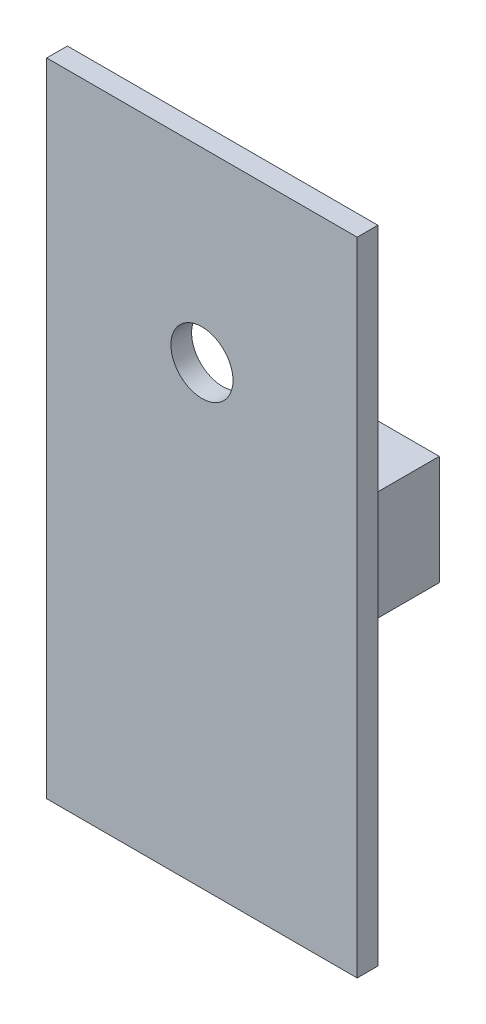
from build123d import *

# Parameters (mm, degrees)
SKETCH1_W           = 15
SKETCH1_H           = 31
SKETCH1_R           = 1.5
BOSS_EXTRUDE1_DEPTH = 1
SKETCH2_W           = 4.865736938
SKETCH2_H           = 5.285779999
BOSS_EXTRUDE2_DEPTH = 4


with BuildPart() as part:
    # Sketch1 → Boss-Extrude1 (new body)
    with BuildSketch(Plane.XY):
        with Locations((-0.516055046, -10.924311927)):
            Rectangle(SKETCH1_W, SKETCH1_H)
        with Locations((-0.516055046, -4.424311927)):
            Circle(SKETCH1_R, mode=Mode.SUBTRACT)
    extrude(amount=BOSS_EXTRUDE1_DEPTH)

    # Sketch2 → Boss-Extrude2 (add)
    with BuildSketch(Plane(origin=(0, 0, 0), x_dir=(-1, 0, 0), z_dir=(0, 0, -1))):
        with Locations((-3.519006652, -10.254209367)):
            Rectangle(SKETCH2_W, SKETCH2_H)
    extrude(amount=BOSS_EXTRUDE2_DEPTH)


solid = part.part
